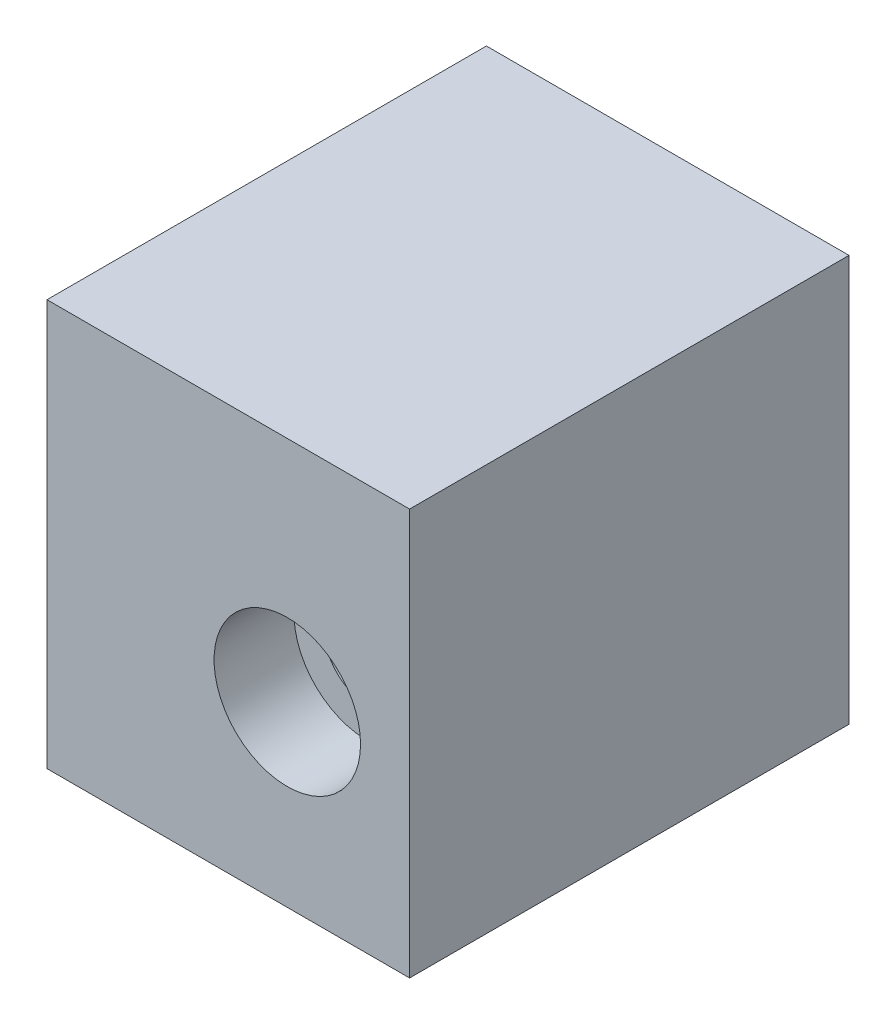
from build123d import *

# Parameters (mm, degrees)
SKIZZE1_W                                            = 27.231968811
SKIZZE1_H                                            = 30.499805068
LINEAR_AUSTRAGEN1_DEPTH                              = 33
STIRNSENKUNG_F_R_M6_ZYLINDERSCHRAUBE_MIT_D           = 6.4
STIRNSENKUNG_F_R_M6_ZYLINDERSCHRAUBE_MIT_CBORE_D     = 11
STIRNSENKUNG_F_R_M6_ZYLINDERSCHRAUBE_MIT_CBORE_DEPTH = 6


with BuildPart() as part:
    # Skizze1 → Linear austragen1 (new body)
    with BuildSketch(Plane.XY):
        with Locations((1.906237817, -2.587037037)):
            Rectangle(SKIZZE1_W, SKIZZE1_H)
    extrude(amount=LINEAR_AUSTRAGEN1_DEPTH)

    # Stirnsenkung f_r M6 Zylinderschraube mit (through all)
    with Locations(Plane.XY.offset(33)):
        with Locations((6.33854373, -4.480001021)):
            CounterBoreHole(STIRNSENKUNG_F_R_M6_ZYLINDERSCHRAUBE_MIT_D / 2, STIRNSENKUNG_F_R_M6_ZYLINDERSCHRAUBE_MIT_CBORE_D / 2, STIRNSENKUNG_F_R_M6_ZYLINDERSCHRAUBE_MIT_CBORE_DEPTH)


solid = part.part
